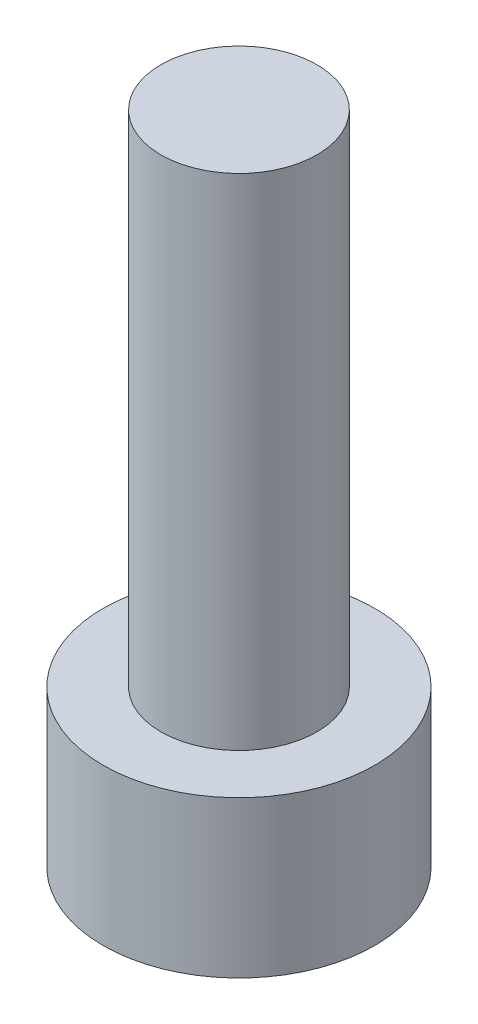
ISO-10303-21;
HEADER;
FILE_DESCRIPTION(('STEP AP214'),'2;1');
FILE_NAME('part.step','',(''),(''),'','','');
FILE_SCHEMA(('AUTOMOTIVE_DESIGN { 1 0 10303 214 1 1 1 1 }'));
ENDSEC;
DATA;
#1=APPLICATION_CONTEXT('core data for automotive mechanical design processes');
#2=APPLICATION_PROTOCOL_DEFINITION('international standard','automotive_design',2000,#1);
#3=PRODUCT_CONTEXT('',#1,'mechanical');
#4=PRODUCT('Part','Part','',(#3));
#5=PRODUCT_RELATED_PRODUCT_CATEGORY('part','',(#4));
#6=PRODUCT_DEFINITION_FORMATION('','',#4);
#7=PRODUCT_DEFINITION_CONTEXT('part definition',#1,'design');
#8=PRODUCT_DEFINITION('design','',#6,#7);
#9=PRODUCT_DEFINITION_SHAPE('','',#8);
#10=(LENGTH_UNIT() NAMED_UNIT(*) SI_UNIT(.MILLI.,.METRE.));
#11=(NAMED_UNIT(*) PLANE_ANGLE_UNIT() SI_UNIT($,.RADIAN.));
#12=(NAMED_UNIT(*) SI_UNIT($,.STERADIAN.) SOLID_ANGLE_UNIT());
#13=UNCERTAINTY_MEASURE_WITH_UNIT(LENGTH_MEASURE(1.E-05),#10,'distance_accuracy_value','');
#14=(GEOMETRIC_REPRESENTATION_CONTEXT(3) GLOBAL_UNCERTAINTY_ASSIGNED_CONTEXT((#13)) GLOBAL_UNIT_ASSIGNED_CONTEXT((#10,
#11,#12)) REPRESENTATION_CONTEXT('',''));
#15=CARTESIAN_POINT('',(0.,0.,0.));
#16=DIRECTION('',(0.,0.,1.));
#17=DIRECTION('',(1.,0.,0.));
#18=AXIS2_PLACEMENT_3D('',#15,#16,#17);
#19=CARTESIAN_POINT('',(0.,5.,0.));
#20=DIRECTION('',(0.,-1.,0.));
#21=DIRECTION('',(0.,0.,-1.));
#22=AXIS2_PLACEMENT_3D('',#19,#20,#21);
#23=CYLINDRICAL_SURFACE('',#22,4.35);
#24=CARTESIAN_POINT('',(0.,5.,0.));
#25=DIRECTION('',(0.,1.,0.));
#26=DIRECTION('',(0.,0.,1.));
#27=AXIS2_PLACEMENT_3D('',#24,#25,#26);
#28=CIRCLE('',#27,4.35);
#29=CARTESIAN_POINT('',(0.,5.,4.35));
#30=VERTEX_POINT('',#29);
#31=EDGE_CURVE('E51',#30,#30,#28,.T.);
#32=ORIENTED_EDGE('',*,*,#31,.F.);
#33=EDGE_LOOP('',(#32));
#34=FACE_BOUND('',#33,.T.);
#35=CARTESIAN_POINT('',(0.,0.,0.));
#36=DIRECTION('',(0.,1.,0.));
#37=DIRECTION('',(0.,0.,1.));
#38=AXIS2_PLACEMENT_3D('',#35,#36,#37);
#39=CIRCLE('',#38,4.35);
#40=CARTESIAN_POINT('',(0.,0.,4.35));
#41=VERTEX_POINT('',#40);
#42=EDGE_CURVE('E46',#41,#41,#39,.T.);
#43=ORIENTED_EDGE('',*,*,#42,.T.);
#44=EDGE_LOOP('',(#43));
#45=FACE_BOUND('',#44,.T.);
#46=ADVANCED_FACE('F43',(#34,#45),#23,.T.);
#47=CARTESIAN_POINT('',(0.,5.,0.));
#48=DIRECTION('',(0.,1.,0.));
#49=DIRECTION('',(0.,0.,1.));
#50=AXIS2_PLACEMENT_3D('',#47,#48,#49);
#51=PLANE('',#50);
#52=CARTESIAN_POINT('',(0.,5.,0.));
#53=DIRECTION('',(0.,1.,0.));
#54=DIRECTION('',(0.,0.,1.));
#55=AXIS2_PLACEMENT_3D('',#52,#53,#54);
#56=CIRCLE('',#55,2.5);
#57=CARTESIAN_POINT('',(0.,5.,2.5));
#58=VERTEX_POINT('',#57);
#59=EDGE_CURVE('E11',#58,#58,#56,.T.);
#60=ORIENTED_EDGE('',*,*,#59,.F.);
#61=EDGE_LOOP('',(#60));
#62=FACE_BOUND('',#61,.T.);
#63=ORIENTED_EDGE('',*,*,#31,.T.);
#64=EDGE_LOOP('',(#63));
#65=FACE_BOUND('',#64,.T.);
#66=ADVANCED_FACE('F161',(#62,#65),#51,.T.);
#67=CARTESIAN_POINT('',(0.,0.,0.));
#68=DIRECTION('',(0.,1.,0.));
#69=DIRECTION('',(0.,0.,1.));
#70=AXIS2_PLACEMENT_3D('',#67,#68,#69);
#71=PLANE('',#70);
#72=DIRECTION('',(0.308424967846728,0.,0.951248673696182));
#73=VECTOR('',#72,1.);
#74=CARTESIAN_POINT('',(1.54635887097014,0.,-1.71525729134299));
#75=LINE('',#74,#73);
#76=CARTESIAN_POINT('',(1.54635887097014,0.,-1.71525729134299));
#77=VERTEX_POINT('',#76);
#78=CARTESIAN_POINT('',(2.25863582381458,0.,0.481557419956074));
#79=VERTEX_POINT('',#78);
#80=EDGE_CURVE('E135',#77,#79,#75,.T.);
#81=ORIENTED_EDGE('',*,*,#80,.F.);
#82=DIRECTION('',(0.978018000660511,0.,0.208520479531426));
#83=VECTOR('',#82,1.);
#84=CARTESIAN_POINT('',(-0.71227695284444,0.,-2.19681471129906));
#85=LINE('',#84,#83);
#86=CARTESIAN_POINT('',(-0.71227695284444,0.,-2.19681471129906));
#87=VERTEX_POINT('',#86);
#88=EDGE_CURVE('E56',#87,#77,#85,.T.);
#89=ORIENTED_EDGE('',*,*,#88,.F.);
#90=DIRECTION('',(0.669593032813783,0.,-0.742728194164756));
#91=VECTOR('',#90,1.);
#92=CARTESIAN_POINT('',(-2.25863582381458,0.,-0.481557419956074));
#93=LINE('',#92,#91);
#94=CARTESIAN_POINT('',(-2.25863582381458,0.,-0.481557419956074));
#95=VERTEX_POINT('',#94);
#96=EDGE_CURVE('E145',#95,#87,#93,.T.);
#97=ORIENTED_EDGE('',*,*,#96,.F.);
#98=DIRECTION('',(-0.308424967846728,0.,-0.951248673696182));
#99=VECTOR('',#98,1.);
#100=CARTESIAN_POINT('',(-1.54635887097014,0.,1.71525729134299));
#101=LINE('',#100,#99);
#102=CARTESIAN_POINT('',(-1.54635887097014,0.,1.71525729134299));
#103=VERTEX_POINT('',#102);
#104=EDGE_CURVE('E137',#103,#95,#101,.T.);
#105=ORIENTED_EDGE('',*,*,#104,.F.);
#106=DIRECTION('',(-0.978018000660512,0.,-0.208520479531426));
#107=VECTOR('',#106,1.);
#108=CARTESIAN_POINT('',(0.71227695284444,0.,2.19681471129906));
#109=LINE('',#108,#107);
#110=CARTESIAN_POINT('',(0.71227695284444,0.,2.19681471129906));
#111=VERTEX_POINT('',#110);
#112=EDGE_CURVE('E110',#111,#103,#109,.T.);
#113=ORIENTED_EDGE('',*,*,#112,.F.);
#114=DIRECTION('',(-0.669593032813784,0.,0.742728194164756));
#115=VECTOR('',#114,1.);
#116=CARTESIAN_POINT('',(2.25863582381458,0.,0.481557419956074));
#117=LINE('',#116,#115);
#118=EDGE_CURVE('E139',#79,#111,#117,.T.);
#119=ORIENTED_EDGE('',*,*,#118,.F.);
#120=EDGE_LOOP('',(#81,#89,#97,#105,#113,#119));
#121=FACE_BOUND('',#120,.T.);
#122=ORIENTED_EDGE('',*,*,#42,.F.);
#123=EDGE_LOOP('',(#122));
#124=FACE_BOUND('',#123,.T.);
#125=ADVANCED_FACE('F157',(#121,#124),#71,.F.);
#126=CARTESIAN_POINT('',(0.,21.,0.));
#127=DIRECTION('',(0.,-1.,0.));
#128=DIRECTION('',(0.,0.,-1.));
#129=AXIS2_PLACEMENT_3D('',#126,#127,#128);
#130=CYLINDRICAL_SURFACE('',#129,2.5);
#131=CARTESIAN_POINT('',(0.,21.,0.));
#132=DIRECTION('',(0.,1.,0.));
#133=DIRECTION('',(0.,0.,1.));
#134=AXIS2_PLACEMENT_3D('',#131,#132,#133);
#135=CIRCLE('',#134,2.5);
#136=CARTESIAN_POINT('',(0.,21.,2.5));
#137=VERTEX_POINT('',#136);
#138=EDGE_CURVE('E147',#137,#137,#135,.T.);
#139=ORIENTED_EDGE('',*,*,#138,.F.);
#140=EDGE_LOOP('',(#139));
#141=FACE_BOUND('',#140,.T.);
#142=ORIENTED_EDGE('',*,*,#59,.T.);
#143=EDGE_LOOP('',(#142));
#144=FACE_BOUND('',#143,.T.);
#145=ADVANCED_FACE('F162',(#141,#144),#130,.T.);
#146=CARTESIAN_POINT('',(0.,21.,0.));
#147=DIRECTION('',(0.,1.,0.));
#148=DIRECTION('',(0.,0.,1.));
#149=AXIS2_PLACEMENT_3D('',#146,#147,#148);
#150=PLANE('',#149);
#151=ORIENTED_EDGE('',*,*,#138,.T.);
#152=EDGE_LOOP('',(#151));
#153=FACE_BOUND('',#152,.T.);
#154=ADVANCED_FACE('F167',(#153),#150,.T.);
#155=CARTESIAN_POINT('',(-0.71227695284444,2.5,-2.19681471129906));
#156=DIRECTION('',(0.208520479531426,0.,-0.978018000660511));
#157=DIRECTION('',(-0.978018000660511,0.,-0.208520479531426));
#158=AXIS2_PLACEMENT_3D('',#155,#156,#157);
#159=PLANE('',#158);
#160=ORIENTED_EDGE('',*,*,#88,.T.);
#161=DIRECTION('',(0.,-1.,0.));
#162=VECTOR('',#161,1.);
#163=CARTESIAN_POINT('',(1.54635887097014,2.5,-1.71525729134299));
#164=LINE('',#163,#162);
#165=CARTESIAN_POINT('',(1.54635887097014,2.5,-1.71525729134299));
#166=VERTEX_POINT('',#165);
#167=EDGE_CURVE('E88',#166,#77,#164,.T.);
#168=ORIENTED_EDGE('',*,*,#167,.F.);
#169=DIRECTION('',(0.978018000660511,0.,0.208520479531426));
#170=VECTOR('',#169,1.);
#171=CARTESIAN_POINT('',(-0.71227695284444,2.5,-2.19681471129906));
#172=LINE('',#171,#170);
#173=CARTESIAN_POINT('',(-0.71227695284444,2.5,-2.19681471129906));
#174=VERTEX_POINT('',#173);
#175=EDGE_CURVE('E144',#174,#166,#172,.T.);
#176=ORIENTED_EDGE('',*,*,#175,.F.);
#177=DIRECTION('',(0.,-1.,0.));
#178=VECTOR('',#177,1.);
#179=CARTESIAN_POINT('',(-0.71227695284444,2.5,-2.19681471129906));
#180=LINE('',#179,#178);
#181=EDGE_CURVE('E66',#174,#87,#180,.T.);
#182=ORIENTED_EDGE('',*,*,#181,.T.);
#183=EDGE_LOOP('',(#160,#168,#176,#182));
#184=FACE_BOUND('',#183,.T.);
#185=ADVANCED_FACE('F200',(#184),#159,.F.);
#186=CARTESIAN_POINT('',(-2.25863582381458,2.5,-0.481557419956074));
#187=DIRECTION('',(-0.742728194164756,0.,-0.669593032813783));
#188=DIRECTION('',(-0.669593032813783,0.,0.742728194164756));
#189=AXIS2_PLACEMENT_3D('',#186,#187,#188);
#190=PLANE('',#189);
#191=ORIENTED_EDGE('',*,*,#96,.T.);
#192=ORIENTED_EDGE('',*,*,#181,.F.);
#193=DIRECTION('',(0.669593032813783,0.,-0.742728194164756));
#194=VECTOR('',#193,1.);
#195=CARTESIAN_POINT('',(-2.25863582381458,2.5,-0.481557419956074));
#196=LINE('',#195,#194);
#197=CARTESIAN_POINT('',(-2.25863582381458,2.5,-0.481557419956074));
#198=VERTEX_POINT('',#197);
#199=EDGE_CURVE('E118',#198,#174,#196,.T.);
#200=ORIENTED_EDGE('',*,*,#199,.F.);
#201=DIRECTION('',(0.,-1.,0.));
#202=VECTOR('',#201,1.);
#203=CARTESIAN_POINT('',(-2.25863582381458,2.5,-0.481557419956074));
#204=LINE('',#203,#202);
#205=EDGE_CURVE('E111',#198,#95,#204,.T.);
#206=ORIENTED_EDGE('',*,*,#205,.T.);
#207=EDGE_LOOP('',(#191,#192,#200,#206));
#208=FACE_BOUND('',#207,.T.);
#209=ADVANCED_FACE('F208',(#208),#190,.F.);
#210=CARTESIAN_POINT('',(-1.54635887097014,2.5,1.71525729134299));
#211=DIRECTION('',(-0.951248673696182,0.,0.308424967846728));
#212=DIRECTION('',(0.308424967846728,0.,0.951248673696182));
#213=AXIS2_PLACEMENT_3D('',#210,#211,#212);
#214=PLANE('',#213);
#215=ORIENTED_EDGE('',*,*,#104,.T.);
#216=ORIENTED_EDGE('',*,*,#205,.F.);
#217=DIRECTION('',(-0.308424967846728,0.,-0.951248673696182));
#218=VECTOR('',#217,1.);
#219=CARTESIAN_POINT('',(-1.54635887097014,2.5,1.71525729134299));
#220=LINE('',#219,#218);
#221=CARTESIAN_POINT('',(-1.54635887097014,2.5,1.71525729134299));
#222=VERTEX_POINT('',#221);
#223=EDGE_CURVE('E114',#222,#198,#220,.T.);
#224=ORIENTED_EDGE('',*,*,#223,.F.);
#225=DIRECTION('',(0.,-1.,0.));
#226=VECTOR('',#225,1.);
#227=CARTESIAN_POINT('',(-1.54635887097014,2.5,1.71525729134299));
#228=LINE('',#227,#226);
#229=EDGE_CURVE('E99',#222,#103,#228,.T.);
#230=ORIENTED_EDGE('',*,*,#229,.T.);
#231=EDGE_LOOP('',(#215,#216,#224,#230));
#232=FACE_BOUND('',#231,.T.);
#233=ADVANCED_FACE('F116',(#232),#214,.F.);
#234=CARTESIAN_POINT('',(0.71227695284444,2.5,2.19681471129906));
#235=DIRECTION('',(-0.208520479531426,0.,0.978018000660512));
#236=DIRECTION('',(0.978018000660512,0.,0.208520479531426));
#237=AXIS2_PLACEMENT_3D('',#234,#235,#236);
#238=PLANE('',#237);
#239=ORIENTED_EDGE('',*,*,#112,.T.);
#240=ORIENTED_EDGE('',*,*,#229,.F.);
#241=DIRECTION('',(-0.978018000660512,0.,-0.208520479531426));
#242=VECTOR('',#241,1.);
#243=CARTESIAN_POINT('',(0.71227695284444,2.5,2.19681471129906));
#244=LINE('',#243,#242);
#245=CARTESIAN_POINT('',(0.71227695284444,2.5,2.19681471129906));
#246=VERTEX_POINT('',#245);
#247=EDGE_CURVE('E104',#246,#222,#244,.T.);
#248=ORIENTED_EDGE('',*,*,#247,.F.);
#249=DIRECTION('',(0.,-1.,0.));
#250=VECTOR('',#249,1.);
#251=CARTESIAN_POINT('',(0.71227695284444,2.5,2.19681471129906));
#252=LINE('',#251,#250);
#253=EDGE_CURVE('E115',#246,#111,#252,.T.);
#254=ORIENTED_EDGE('',*,*,#253,.T.);
#255=EDGE_LOOP('',(#239,#240,#248,#254));
#256=FACE_BOUND('',#255,.T.);
#257=ADVANCED_FACE('F105',(#256),#238,.F.);
#258=CARTESIAN_POINT('',(2.25863582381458,2.5,0.481557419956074));
#259=DIRECTION('',(0.742728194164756,0.,0.669593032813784));
#260=DIRECTION('',(0.669593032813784,0.,-0.742728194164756));
#261=AXIS2_PLACEMENT_3D('',#258,#259,#260);
#262=PLANE('',#261);
#263=ORIENTED_EDGE('',*,*,#118,.T.);
#264=ORIENTED_EDGE('',*,*,#253,.F.);
#265=DIRECTION('',(-0.669593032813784,0.,0.742728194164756));
#266=VECTOR('',#265,1.);
#267=CARTESIAN_POINT('',(2.25863582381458,2.5,0.481557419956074));
#268=LINE('',#267,#266);
#269=CARTESIAN_POINT('',(2.25863582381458,2.5,0.481557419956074));
#270=VERTEX_POINT('',#269);
#271=EDGE_CURVE('E123',#270,#246,#268,.T.);
#272=ORIENTED_EDGE('',*,*,#271,.F.);
#273=DIRECTION('',(0.,-1.,0.));
#274=VECTOR('',#273,1.);
#275=CARTESIAN_POINT('',(2.25863582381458,2.5,0.481557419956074));
#276=LINE('',#275,#274);
#277=EDGE_CURVE('E146',#270,#79,#276,.T.);
#278=ORIENTED_EDGE('',*,*,#277,.T.);
#279=EDGE_LOOP('',(#263,#264,#272,#278));
#280=FACE_BOUND('',#279,.T.);
#281=ADVANCED_FACE('F232',(#280),#262,.F.);
#282=CARTESIAN_POINT('',(1.54635887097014,2.5,-1.71525729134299));
#283=DIRECTION('',(0.951248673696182,0.,-0.308424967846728));
#284=DIRECTION('',(-0.308424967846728,0.,-0.951248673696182));
#285=AXIS2_PLACEMENT_3D('',#282,#283,#284);
#286=PLANE('',#285);
#287=ORIENTED_EDGE('',*,*,#80,.T.);
#288=ORIENTED_EDGE('',*,*,#277,.F.);
#289=DIRECTION('',(0.308424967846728,0.,0.951248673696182));
#290=VECTOR('',#289,1.);
#291=CARTESIAN_POINT('',(1.54635887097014,2.5,-1.71525729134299));
#292=LINE('',#291,#290);
#293=EDGE_CURVE('E130',#166,#270,#292,.T.);
#294=ORIENTED_EDGE('',*,*,#293,.F.);
#295=ORIENTED_EDGE('',*,*,#167,.T.);
#296=EDGE_LOOP('',(#287,#288,#294,#295));
#297=FACE_BOUND('',#296,.T.);
#298=ADVANCED_FACE('F242',(#297),#286,.F.);
#299=CARTESIAN_POINT('',(0.,2.5,0.));
#300=DIRECTION('',(0.,-1.,0.));
#301=DIRECTION('',(0.,0.,-1.));
#302=AXIS2_PLACEMENT_3D('',#299,#300,#301);
#303=PLANE('',#302);
#304=ORIENTED_EDGE('',*,*,#175,.T.);
#305=ORIENTED_EDGE('',*,*,#293,.T.);
#306=ORIENTED_EDGE('',*,*,#271,.T.);
#307=ORIENTED_EDGE('',*,*,#247,.T.);
#308=ORIENTED_EDGE('',*,*,#223,.T.);
#309=ORIENTED_EDGE('',*,*,#199,.T.);
#310=EDGE_LOOP('',(#304,#305,#306,#307,#308,#309));
#311=FACE_BOUND('',#310,.T.);
#312=ADVANCED_FACE('F125',(#311),#303,.T.);
#313=CLOSED_SHELL('',(#46,#66,#125,#145,#154,#185,#209,#233,#257,#281,#298,#312));
#314=MANIFOLD_SOLID_BREP('B2',#313);
#315=ADVANCED_BREP_SHAPE_REPRESENTATION('',(#18,#314),#14);
#316=SHAPE_DEFINITION_REPRESENTATION(#9,#315);
ENDSEC;
END-ISO-10303-21;
